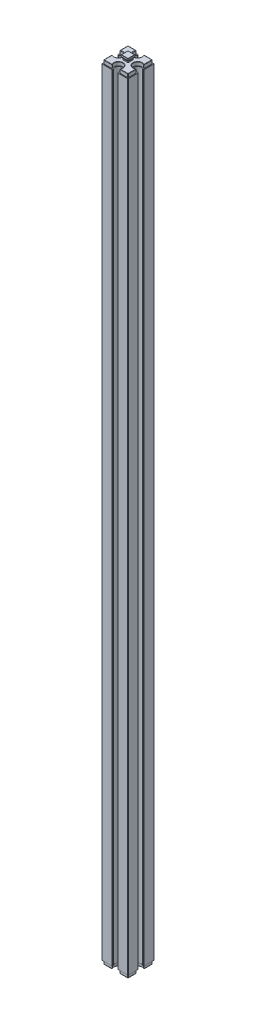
from build123d import *

# Parameters (mm, degrees)
EXTRUDE_1_DEPTH        = 223
EXTRUDE_2_DEPTH        = 2
EXTRUDE_3_DEPTH        = 2
FILLET_3_R             = 0.2
CUT_EXTRUDE_1_DEPTH    = 3
FILLET_4_R             = 0.2
FILLET_5_R             = 0.1
FILLET_3_OF_MIRROR_1_R = 0.2
FILLET_4_OF_MIRROR_1_R = 0.2
FILLET_5_OF_MIRROR_1_R = 0.1


with BuildPart() as part:
    # Sketch 1 → Extrude 1 (new body)
    with BuildSketch(Plane(origin=(0, 0, 0), x_dir=(1, 0, 0), z_dir=(0, 1, 0))):
        with BuildLine():
            Line((-7.5, 7.5), (-1.5, 7.5))
            Line((-1.5, 7.5), (-1.5, 6.822875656))
            ThreePointArc((-1.5, 6.822875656), (0, 3.5), (1.5, 6.822875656))
            Line((1.5, 6.822875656), (1.5, 7.5))
            Line((1.5, 7.5), (7.5, 7.5))
            Line((7.5, 7.5), (7.5, 1.5))
            Line((7.5, 1.5), (6.822875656, 1.5))
            ThreePointArc((6.822875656, 1.5), (3.5, 0), (6.822875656, -1.5))
            Line((6.822875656, -1.5), (7.5, -1.5))
            Line((7.5, -1.5), (7.5, -7.5))
            Line((7.5, -7.5), (1.5, -7.5))
            Line((1.5, -7.5), (1.5, -6.822875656))
            ThreePointArc((1.5, -6.822875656), (0, -3.5), (-1.5, -6.822875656))
            Line((-1.5, -6.822875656), (-1.5, -7.5))
            Line((-1.5, -7.5), (-7.5, -7.5))
            Line((-7.5, -7.5), (-7.5, -1.5))
            Line((-7.5, -1.5), (-6.822875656, -1.5))
            ThreePointArc((-6.822875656, -1.5), (-3.5, 0), (-6.822875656, 1.5))
            Line((-6.822875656, 1.5), (-7.5, 1.5))
            Line((-7.5, 1.5), (-7.5, 7.5))
        make_face()
    extrude_1 = extrude(amount=EXTRUDE_1_DEPTH)

    # Sketch 2 → Extrude 2 (add)
    with BuildSketch(Plane(origin=(0, 223, 0), x_dir=(1, 0, 0), z_dir=(0, 1, 0))):
        with BuildLine():
            Line((-7, 7), (-7, 2))
            ThreePointArc((-7, 2), (-3, 0), (-7, -2))
            Line((-7, -2), (-7, -7))
            Line((-7, -7), (-2, -7))
            ThreePointArc((-2, -7), (0, -3), (2, -7))
            Line((2, -7), (7, -7))
            Line((7, -7), (7, -2))
            ThreePointArc((7, -2), (3, 0), (7, 2))
            Line((7, 2), (7, 7))
            Line((7, 7), (2, 7))
            ThreePointArc((2, 7), (0, 3), (-2, 7))
            Line((-2, 7), (-7, 7))
        make_face()
    extrude_2 = extrude(amount=EXTRUDE_2_DEPTH)

    # Sketch 3 → Extrude 3 (add, symmetric)
    with BuildSketch(Plane(origin=(0, 0, 0), x_dir=(0, 0, -1), z_dir=(1, 0, 0))):
        with BuildLine():
            Line((-1.5, 225), (1.5, 225))
            Line((1.5, 225), (1.5, 225.677124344))
            ThreePointArc((1.5, 225.677124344), (1.780042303, 226.088161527), (1.95, 226.555590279))
            Line((1.95, 226.555590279), (1.95, 227.5))
            Line((1.95, 227.5), (-1.95, 227.5))
            Line((-1.95, 227.5), (-1.95, 226.555590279))
            ThreePointArc((-1.95, 226.555590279), (-1.780042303, 226.088161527), (-1.5, 225.677124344))
            Line((-1.5, 225.677124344), (-1.5, 225))
        make_face()
    extrude_3 = extrude(amount=EXTRUDE_3_DEPTH, both=True)

    # Fillet 3
    fillet_3_edges = [part.edges().sort_by_distance(p)[0] for p in [
        (-7.5, 111.5, -7.5),
        (-1.5, 111.5, -7.5),
        (1.5, 111.5, -7.5),
        (7.5, 111.5, -7.5),
        (7.5, 111.5, -1.5),
        (7.5, 111.5, 1.5),
        (7.5, 111.5, 7.5),
        (1.5, 111.5, 7.5),
        (-1.5, 111.5, 7.5),
        (-7.5, 111.5, 7.5),
        (-7.5, 111.5, 1.5),
        (-6.822875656, 111.5, -1.5),
        (-7.5, 111.5, -1.5),
    ]]
    fillet(fillet_3_edges, radius=FILLET_3_R)

    # Sketch 4 → Cut-Extrude 1 (cut, symmetric)
    with BuildSketch(Plane.XY):
        with BuildLine():
            Line((1.95, 227.5), (2, 227.5))
            Line((2, 227.5), (2, 225))
            Line((2, 225), (1.5, 225))
            Line((1.5, 225), (1.5, 225.677124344))
            ThreePointArc((1.5, 225.677124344), (1.780042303, 226.088161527), (1.95, 226.555590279))
            Line((1.95, 226.555590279), (1.95, 227.5))
        make_face()
        with BuildLine():
            Line((-1.95, 227.5), (-1.95, 226.555590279))
            ThreePointArc((-1.95, 226.555590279), (-1.780042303, 226.088161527), (-1.5, 225.677124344))
            Line((-1.5, 225.677124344), (-1.5, 225))
            Line((-1.5, 225), (-2, 225))
            Line((-2, 225), (-2, 227.5))
            Line((-2, 227.5), (-1.95, 227.5))
        make_face()
    cut_extrude_1 = extrude(amount=CUT_EXTRUDE_1_DEPTH, both=True, mode=Mode.SUBTRACT)

    # Fillet 4
    fillet_4_edges = [part.edges().sort_by_distance(p)[0] for p in [
        (-2, 224, -7),
        (-7, 224, -7),
        (-7, 224, -2),
        (-7, 224, 2),
        (-7, 224, 7),
        (-2, 224, 7),
        (2, 224, 7),
        (7, 224, 7),
        (7, 224, 2),
        (7, 224, -2),
        (7, 224, -7),
        (2, 224, -7),
        (-4.5, 225, -7),
        (-7, 225, -4.5),
        (-3, 225, 0),
        (-7, 225, 4.5),
        (-4.5, 225, 7),
        (0, 225, 3),
        (4.5, 225, 7),
        (7, 225, 4.5),
        (3, 225, 0),
        (7, 225, -4.5),
        (4.5, 225, -7),
        (0, 225, -3),
    ]]
    fillet(fillet_4_edges, radius=FILLET_4_R)

    # Fillet 5
    fillet_5_edges = [part.edges().sort_by_distance(p)[0] for p in [
        (1.95, 227.5, 0),
        (0, 227.5, -1.95),
        (0, 227.5, 1.95),
        (-1.95, 227.5, 0),
    ]]
    fillet(fillet_5_edges, radius=FILLET_5_R)

    # Mirror 1: Extrude 1, Extrude 2, Extrude 3, Cut-Extrude 1 across Top Plane
    add(extrude_1.mirror(Plane(origin=(0, 0, 0), x_dir=(1, 0, 0), z_dir=(0, 1, 0))))
    add(extrude_2.mirror(Plane(origin=(0, 0, 0), x_dir=(1, 0, 0), z_dir=(0, 1, 0))))
    add(extrude_3.mirror(Plane(origin=(0, 0, 0), x_dir=(1, 0, 0), z_dir=(0, 1, 0))))
    add(cut_extrude_1.mirror(Plane(origin=(0, 0, 0), x_dir=(1, 0, 0), z_dir=(0, 1, 0))), mode=Mode.SUBTRACT)

    # Fillet 3 of Mirror 1
    fillet_3_of_mirror_1_edges = [part.edges().sort_by_distance(p)[0] for p in [
        (-7.5, -111.5, -7.5),
        (-1.5, -111.5, -7.5),
        (1.5, -111.5, -7.5),
        (7.5, -111.5, -7.5),
        (7.5, -111.5, -1.5),
        (7.5, -111.5, 1.5),
        (7.5, -111.5, 7.5),
        (1.5, -111.5, 7.5),
        (-1.5, -111.5, 7.5),
        (-7.5, -111.5, 7.5),
        (-7.5, -111.5, 1.5),
        (-6.822875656, -111.5, -1.5),
        (-7.5, -111.5, -1.5),
    ]]
    fillet(fillet_3_of_mirror_1_edges, radius=FILLET_3_OF_MIRROR_1_R)

    # Fillet 4 of Mirror 1
    fillet_4_of_mirror_1_edges = [part.edges().sort_by_distance(p)[0] for p in [
        (-2, -224, -7),
        (-7, -224, -7),
        (-7, -224, -2),
        (-7, -224, 2),
        (-7, -224, 7),
        (-2, -224, 7),
        (2, -224, 7),
        (7, -224, 7),
        (7, -224, 2),
        (7, -224, -2),
        (7, -224, -7),
        (2, -224, -7),
        (-4.5, -225, -7),
        (-7, -225, -4.5),
        (-3, -225, 0),
        (-7, -225, 4.5),
        (-4.5, -225, 7),
        (0, -225, 3),
        (4.5, -225, 7),
        (7, -225, 4.5),
        (3, -225, 0),
        (7, -225, -4.5),
        (4.5, -225, -7),
        (0, -225, -3),
    ]]
    fillet(fillet_4_of_mirror_1_edges, radius=FILLET_4_OF_MIRROR_1_R)

    # Fillet 5 of Mirror 1
    fillet_5_of_mirror_1_edges = [part.edges().sort_by_distance(p)[0] for p in [
        (1.95, -227.5, 0),
        (0, -227.5, -1.95),
        (0, -227.5, 1.95),
        (-1.95, -227.5, 0),
    ]]
    fillet(fillet_5_of_mirror_1_edges, radius=FILLET_5_OF_MIRROR_1_R)


solid = part.part
